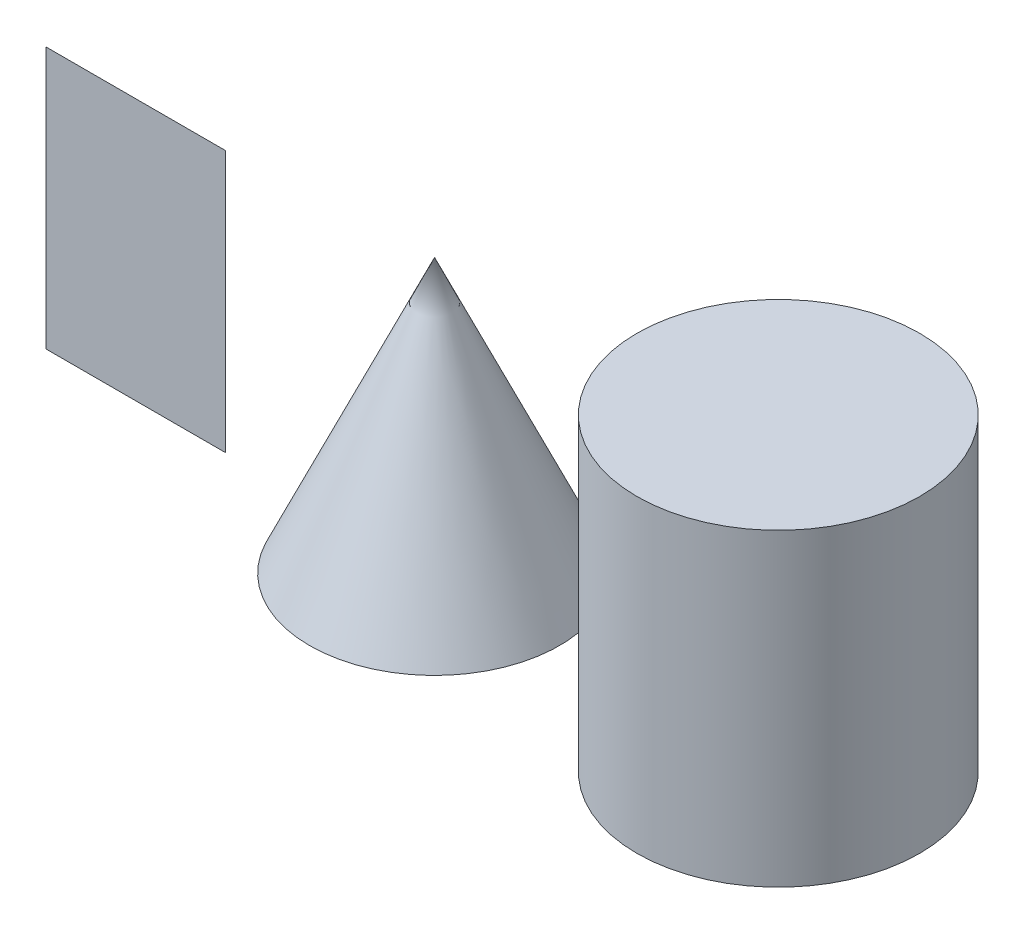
from build123d import *

# Parameters (mm, degrees)
SKETCH3_W = 22.138014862
SKETCH3_H = 48.395769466


with BuildPart() as part:
    # Sketch2 → Revolve1 (revolve)
    with BuildSketch(Plane.XY, mode=Mode.PRIVATE) as revolve1_sk:
        Polygon((60.837613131, 42.838969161), (60.837613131, 0), (41.249885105, 0), align=None)
    revolve(revolve1_sk.sketch.rotate(Axis((60.837613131, 42.838969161, 0), (0, -1, 0)), 90), axis=Axis((60.837613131, 42.838969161, 0), (0, -1, 0)))


with BuildPart() as body_2:
    # Sketch3 → Revolve2 (revolve)
    with BuildSketch(Plane.XY, mode=Mode.PRIVATE) as revolve2_sk:
        with Locations((103.590468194, 24.197884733)):
            Rectangle(SKETCH3_W, SKETCH3_H)
    revolve(revolve2_sk.sketch.rotate(Axis((114.659475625, 48.395769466, 0), (0, -1, 0)), 270), axis=Axis((114.659475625, 48.395769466, 0), (0, -1, 0)))


solid = Compound([part.part, body_2.part])
